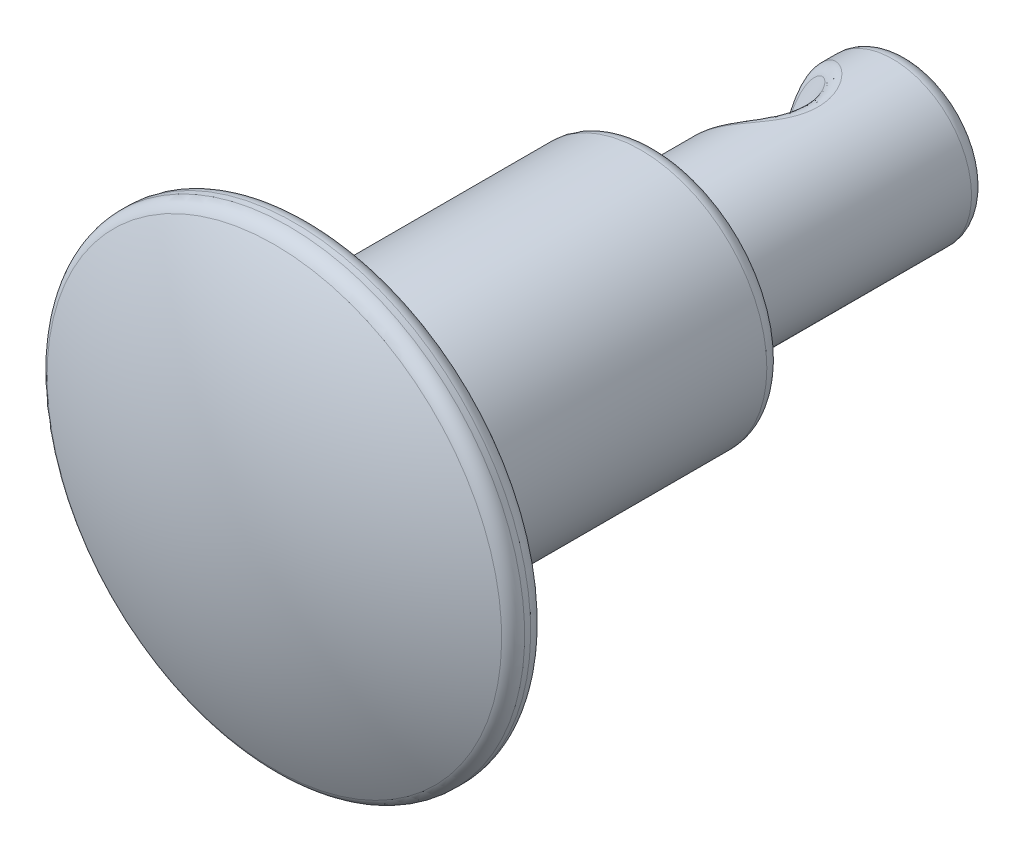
ISO-10303-21;
HEADER;
FILE_DESCRIPTION(('STEP AP214'),'2;1');
FILE_NAME('part.step','',(''),(''),'','','');
FILE_SCHEMA(('AUTOMOTIVE_DESIGN { 1 0 10303 214 1 1 1 1 }'));
ENDSEC;
DATA;
#1=APPLICATION_CONTEXT('core data for automotive mechanical design processes');
#2=APPLICATION_PROTOCOL_DEFINITION('international standard','automotive_design',2000,#1);
#3=PRODUCT_CONTEXT('',#1,'mechanical');
#4=PRODUCT('Part','Part','',(#3));
#5=PRODUCT_RELATED_PRODUCT_CATEGORY('part','',(#4));
#6=PRODUCT_DEFINITION_FORMATION('','',#4);
#7=PRODUCT_DEFINITION_CONTEXT('part definition',#1,'design');
#8=PRODUCT_DEFINITION('design','',#6,#7);
#9=PRODUCT_DEFINITION_SHAPE('','',#8);
#10=(LENGTH_UNIT() NAMED_UNIT(*) SI_UNIT(.MILLI.,.METRE.));
#11=(NAMED_UNIT(*) PLANE_ANGLE_UNIT() SI_UNIT($,.RADIAN.));
#12=(NAMED_UNIT(*) SI_UNIT($,.STERADIAN.) SOLID_ANGLE_UNIT());
#13=UNCERTAINTY_MEASURE_WITH_UNIT(LENGTH_MEASURE(1.E-05),#10,'distance_accuracy_value','');
#14=(GEOMETRIC_REPRESENTATION_CONTEXT(3) GLOBAL_UNCERTAINTY_ASSIGNED_CONTEXT((#13)) GLOBAL_UNIT_ASSIGNED_CONTEXT((#10,
#11,#12)) REPRESENTATION_CONTEXT('',''));
#15=CARTESIAN_POINT('',(0.,0.,0.));
#16=DIRECTION('',(0.,0.,1.));
#17=DIRECTION('',(1.,0.,0.));
#18=AXIS2_PLACEMENT_3D('',#15,#16,#17);
#19=CARTESIAN_POINT('',(0.,0.,10.9015307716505));
#20=DIRECTION('',(0.,0.,1.));
#21=DIRECTION('',(0.,-1.,0.));
#22=AXIS2_PLACEMENT_3D('',#19,#20,#21);
#23=CYLINDRICAL_SURFACE('',#22,2.5);
#24=CARTESIAN_POINT('',(-1.96445623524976,1.16162358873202,-9.55247852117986));
#25=CARTESIAN_POINT('',(-2.15119257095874,1.27372470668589,-9.7013854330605));
#26=CARTESIAN_POINT('',(-2.15015879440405,1.27546742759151,-9.96521545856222));
#27=CARTESIAN_POINT('',(-1.91755010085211,1.24110235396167,-9.55191166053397));
#28=CARTESIAN_POINT('',(-2.09666470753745,1.36582846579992,-9.70078815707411));
#29=CARTESIAN_POINT('',(-2.09130162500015,1.37468609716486,-9.96450688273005));
#30=CARTESIAN_POINT('',(-1.86625049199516,1.3179258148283,-9.54786829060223));
#31=CARTESIAN_POINT('',(-2.03628032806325,1.45435099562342,-9.69653723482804));
#32=CARTESIAN_POINT('',(-2.02556402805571,1.46978287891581,-9.95945267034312));
#33=CARTESIAN_POINT('',(-1.75645262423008,1.46416372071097,-9.53256783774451));
#34=CARTESIAN_POINT('',(-1.90572042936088,1.62194473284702,-9.68034796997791));
#35=CARTESIAN_POINT('',(-1.88240122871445,1.64916046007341,-9.94032710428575));
#36=CARTESIAN_POINT('',(-1.69795431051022,1.53357810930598,-9.52131069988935));
#37=CARTESIAN_POINT('',(-1.83560277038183,1.70096237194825,-9.66842288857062));
#38=CARTESIAN_POINT('',(-1.8049759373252,1.73344117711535,-9.92625568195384));
#39=CARTESIAN_POINT('',(-1.57592121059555,1.66317417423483,-9.49096261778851));
#40=CARTESIAN_POINT('',(-1.68849125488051,1.84759166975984,-9.63601489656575));
#41=CARTESIAN_POINT('',(-1.64139995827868,1.88905702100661,-9.8883205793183));
#42=CARTESIAN_POINT('',(-1.51238869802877,1.72335998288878,-9.47187519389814));
#43=CARTESIAN_POINT('',(-1.61151912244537,1.91521503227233,-9.6155496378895));
#44=CARTESIAN_POINT('',(-1.55525320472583,1.96039794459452,-9.8644612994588));
#45=CARTESIAN_POINT('',(-1.38302595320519,1.8331534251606,-9.42512636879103));
#46=CARTESIAN_POINT('',(-1.45440650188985,2.03786662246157,-9.56504849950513));
#47=CARTESIAN_POINT('',(-1.37811703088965,2.08871789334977,-9.80602526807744));
#48=CARTESIAN_POINT('',(-1.3171967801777,1.88276586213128,-9.39746887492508));
#49=CARTESIAN_POINT('',(-1.37421630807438,2.09295691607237,-9.53500984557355));
#50=CARTESIAN_POINT('',(-1.28712983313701,2.14570344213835,-9.77145340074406));
#51=CARTESIAN_POINT('',(-1.18834436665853,1.96952886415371,-9.3340286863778));
#52=CARTESIAN_POINT('',(-1.21723474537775,2.18893400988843,-9.46574586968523));
#53=CARTESIAN_POINT('',(-1.10763265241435,2.24350162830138,-9.69215316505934));
#54=CARTESIAN_POINT('',(-1.12529533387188,2.00700112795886,-9.29850694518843));
#55=CARTESIAN_POINT('',(-1.14030571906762,2.23025434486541,-9.4267677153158));
#56=CARTESIAN_POINT('',(-1.01912794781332,2.28473807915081,-9.64775098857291));
#57=CARTESIAN_POINT('',(-1.00302501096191,2.07175870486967,-9.21900999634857));
#58=CARTESIAN_POINT('',(-0.991302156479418,2.30169480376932,-9.33933647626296));
#59=CARTESIAN_POINT('',(-0.846420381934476,2.35419815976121,-9.54837980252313));
#60=CARTESIAN_POINT('',(-0.943803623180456,2.09904427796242,-9.17503500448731));
#61=CARTESIAN_POINT('',(-0.919106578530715,2.33185966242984,-9.2907938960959));
#62=CARTESIAN_POINT('',(-0.762217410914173,2.38242212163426,-9.49341106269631));
#63=CARTESIAN_POINT('',(-0.831539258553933,2.1447509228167,-9.07920582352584));
#64=CARTESIAN_POINT('',(-0.782502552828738,2.38278302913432,-9.18504619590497));
#65=CARTESIAN_POINT('',(-0.601781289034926,2.42793210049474,-9.37362458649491));
#66=CARTESIAN_POINT('',(-0.778516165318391,2.16314402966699,-9.02732744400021));
#67=CARTESIAN_POINT('',(-0.718034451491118,2.40352239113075,-9.12770141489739));
#68=CARTESIAN_POINT('',(-0.525573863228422,2.44518366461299,-9.30877661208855));
#69=CARTESIAN_POINT('',(-0.680568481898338,2.19282654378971,-8.91697459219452));
#70=CARTESIAN_POINT('',(-0.599170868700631,2.43764581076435,-9.00599067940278));
#71=CARTESIAN_POINT('',(-0.384217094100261,2.47134767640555,-9.17083554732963));
#72=CARTESIAN_POINT('',(-0.635647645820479,2.20411266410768,-8.85849708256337));
#73=CARTESIAN_POINT('',(-0.544761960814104,2.45101107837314,-8.94152303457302));
#74=CARTESIAN_POINT('',(-0.319072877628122,2.48025626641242,-9.0977386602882));
#75=CARTESIAN_POINT('',(-0.550778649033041,2.22250025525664,-8.7302108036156));
#76=CARTESIAN_POINT('',(-0.442095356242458,2.47360221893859,-8.80051585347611));
#77=CARTESIAN_POINT('',(-0.195598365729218,2.49318838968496,-8.93738081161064));
#78=CARTESIAN_POINT('',(-0.511778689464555,2.22906960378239,-8.65985372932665));
#79=CARTESIAN_POINT('',(-0.395086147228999,2.48224153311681,-8.72339410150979));
#80=CARTESIAN_POINT('',(-0.138603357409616,2.49663350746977,-8.84943446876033));
#81=CARTESIAN_POINT('',(-0.44508637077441,2.23851074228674,-8.51462677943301));
#82=CARTESIAN_POINT('',(-0.31475330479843,2.49551355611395,-8.56477600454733));
#83=CARTESIAN_POINT('',(-0.04089564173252,2.500143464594,-8.66790078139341));
#84=CARTESIAN_POINT('',(-0.41740048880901,2.24138041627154,-8.43975434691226));
#85=CARTESIAN_POINT('',(-0.281547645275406,2.50011578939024,-8.48331502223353));
#86=CARTESIAN_POINT('',(-0.000192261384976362,2.50020637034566,-8.5743102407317));
#87=CARTESIAN_POINT('',(-0.370037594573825,2.24553802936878,-8.2757640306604));
#88=CARTESIAN_POINT('',(-0.224687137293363,2.50740856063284,-8.30529395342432));
#89=CARTESIAN_POINT('',(0.0695417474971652,2.49931564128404,-8.36932234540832));
#90=CARTESIAN_POINT('',(-0.35216631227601,2.24652691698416,-8.18618470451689));
#91=CARTESIAN_POINT('',(-0.20336218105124,2.50968613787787,-8.20854919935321));
#92=CARTESIAN_POINT('',(0.0959327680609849,2.49820928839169,-8.2573481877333));
#93=CARTESIAN_POINT('',(-0.331148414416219,2.24762299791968,-8.00547495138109));
#94=CARTESIAN_POINT('',(-0.178209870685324,2.51232307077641,-8.01345270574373));
#95=CARTESIAN_POINT('',(0.126979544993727,2.49681924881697,-8.03146099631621));
#96=CARTESIAN_POINT('',(-0.32801033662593,2.24772968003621,-7.91434365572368));
#97=CARTESIAN_POINT('',(-0.174475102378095,2.51267247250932,-7.91541375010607));
#98=CARTESIAN_POINT('',(0.131622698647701,2.49653603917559,-7.91754687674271));
#99=CARTESIAN_POINT('',(-0.336805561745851,2.24733159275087,-7.7245634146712));
#100=CARTESIAN_POINT('',(-0.184991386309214,2.5116162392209,-7.71074066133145));
#101=CARTESIAN_POINT('',(0.11862254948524,2.49719819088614,-7.6803215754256));
#102=CARTESIAN_POINT('',(-0.35010636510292,2.24677150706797,-7.62596796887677));
#103=CARTESIAN_POINT('',(-0.200830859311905,2.5100557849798,-7.60452375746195));
#104=CARTESIAN_POINT('',(0.0989570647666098,2.4982552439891,-7.55707726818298));
#105=CARTESIAN_POINT('',(-0.394362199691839,2.24356190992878,-7.4322860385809));
#106=CARTESIAN_POINT('',(-0.253885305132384,2.50379216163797,-7.39477416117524));
#107=CARTESIAN_POINT('',(0.0337062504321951,2.49998449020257,-7.31497485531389));
#108=CARTESIAN_POINT('',(-0.425322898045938,2.24091172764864,-7.33720069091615));
#109=CARTESIAN_POINT('',(-0.290922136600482,2.49911271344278,-7.29156697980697));
#110=CARTESIAN_POINT('',(-0.0118873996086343,2.50065655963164,-7.19611817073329));
#111=CARTESIAN_POINT('',(-0.504551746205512,2.23037192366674,-7.15488598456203));
#112=CARTESIAN_POINT('',(-0.386314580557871,2.4839281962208,-7.09261141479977));
#113=CARTESIAN_POINT('',(-0.128053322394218,2.49738478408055,-6.96822478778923));
#114=CARTESIAN_POINT('',(-0.552591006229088,2.22255046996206,-7.06757096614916));
#115=CARTESIAN_POINT('',(-0.444169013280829,2.47355045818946,-6.99689311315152));
#116=CARTESIAN_POINT('',(-0.198295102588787,2.49350049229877,-6.85908101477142));
#117=CARTESIAN_POINT('',(-0.665304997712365,2.1971253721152,-6.9029783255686));
#118=CARTESIAN_POINT('',(-0.580551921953,2.44262630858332,-6.81593248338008));
#119=CARTESIAN_POINT('',(-0.362144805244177,2.47499096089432,-6.65334021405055));
#120=CARTESIAN_POINT('',(-0.729951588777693,2.17953821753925,-6.82568405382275));
#121=CARTESIAN_POINT('',(-0.658946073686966,2.42215843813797,-6.73053582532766));
#122=CARTESIAN_POINT('',(-0.45571319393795,2.46038381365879,-6.55672237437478));
#123=CARTESIAN_POINT('',(-0.863886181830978,2.13266703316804,-6.69344666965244));
#124=CARTESIAN_POINT('',(-0.821752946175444,2.36922422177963,-6.58454729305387));
#125=CARTESIAN_POINT('',(-0.648155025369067,2.41626127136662,-6.39142564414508));
#126=CARTESIAN_POINT('',(-0.931535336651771,2.10515731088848,-6.63691078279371));
#127=CARTESIAN_POINT('',(-0.904172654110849,2.33864231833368,-6.52202376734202));
#128=CARTESIAN_POINT('',(-0.744836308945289,2.38888074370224,-6.32075578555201));
#129=CARTESIAN_POINT('',(-1.07356312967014,2.03614494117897,-6.53562220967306));
#130=CARTESIAN_POINT('',(-1.07718949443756,2.26238824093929,-6.41045162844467));
#131=CARTESIAN_POINT('',(-0.9462921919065,2.31644438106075,-6.1941450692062));
#132=CARTESIAN_POINT('',(-1.14793504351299,1.99465616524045,-6.49085792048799));
#133=CARTESIAN_POINT('',(-1.16797174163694,2.2166743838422,-6.3612185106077));
#134=CARTESIAN_POINT('',(-1.05105868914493,2.27140606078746,-6.13818970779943));
#135=CARTESIAN_POINT('',(-1.28784728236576,1.90369787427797,-6.41895129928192));
#136=CARTESIAN_POINT('',(-1.33846115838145,2.11615133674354,-6.28260085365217));
#137=CARTESIAN_POINT('',(-1.24640302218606,2.16953292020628,-6.04830643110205));
#138=CARTESIAN_POINT('',(-1.35315523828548,1.85617691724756,-6.39021462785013));
#139=CARTESIAN_POINT('',(-1.41805244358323,2.06346045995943,-6.2513357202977));
#140=CARTESIAN_POINT('',(-1.33689981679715,2.11525486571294,-6.01238559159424));
#141=CARTESIAN_POINT('',(-1.48200163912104,1.75059236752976,-6.34124207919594));
#142=CARTESIAN_POINT('',(-1.57465163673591,1.9457224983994,-6.19833947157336));
#143=CARTESIAN_POINT('',(-1.51383953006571,1.99245558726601,-5.95116990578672));
#144=CARTESIAN_POINT('',(-1.54553915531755,1.69252335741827,-6.32101058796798));
#145=CARTESIAN_POINT('',(-1.65171896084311,1.88060953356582,-6.17660109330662));
#146=CARTESIAN_POINT('',(-1.60028033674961,1.92392704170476,-5.9258805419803));
#147=CARTESIAN_POINT('',(-1.66659645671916,1.56858345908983,-6.28875274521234));
#148=CARTESIAN_POINT('',(-1.79788414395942,1.74068364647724,-6.14209154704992));
#149=CARTESIAN_POINT('',(-1.763173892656,1.77569204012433,-5.88555823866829));
#150=CARTESIAN_POINT('',(-1.72422224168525,1.50292684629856,-6.27654552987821));
#151=CARTESIAN_POINT('',(-1.86712082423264,1.66611595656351,-6.12913299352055));
#152=CARTESIAN_POINT('',(-1.83981298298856,1.69628455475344,-5.87029921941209));
#153=CARTESIAN_POINT('',(-1.83301757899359,1.3644029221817,-6.25899044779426));
#154=CARTESIAN_POINT('',(-1.99691400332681,1.50774639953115,-6.11053074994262));
#155=CARTESIAN_POINT('',(-1.98253232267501,1.52701755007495,-5.84835536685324));
#156=CARTESIAN_POINT('',(-1.8841980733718,1.29154821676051,-6.25363081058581));
#157=CARTESIAN_POINT('',(-2.05743707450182,1.42399877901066,-6.1048877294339));
#158=CARTESIAN_POINT('',(-2.0486305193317,1.43717625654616,-5.84165582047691));
#159=CARTESIAN_POINT('',(-1.95204316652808,1.18301723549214,-6.25061062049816));
#160=CARTESIAN_POINT('',(-2.13679118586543,1.29853157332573,-6.10170540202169));
#161=CARTESIAN_POINT('',(-2.13463188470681,1.30220337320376,-5.83788058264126));
#162=CARTESIAN_POINT('',(-1.97193322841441,1.14947181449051,-6.25031545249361));
#163=CARTESIAN_POINT('',(-2.15992416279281,1.25966618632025,-6.10139411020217));
#164=CARTESIAN_POINT('',(-2.15961088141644,1.26033890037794,-5.8375116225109));
#165=CARTESIAN_POINT('',(-2.01011290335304,1.08151301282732,-6.25097154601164));
#166=CARTESIAN_POINT('',(-2.20405750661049,1.18076303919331,-6.10208556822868));
#167=CARTESIAN_POINT('',(-2.20707592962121,1.17524035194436,-5.83833173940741));
#168=CARTESIAN_POINT('',(-2.02840242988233,1.04709958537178,-6.25192287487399));
#169=CARTESIAN_POINT('',(-2.2250540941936,1.14073199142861,-6.10308827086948));
#170=CARTESIAN_POINT('',(-2.22956184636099,1.13200620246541,-5.839520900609));
#171=CARTESIAN_POINT('',(-2.08642685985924,0.931447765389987,-6.25717630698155));
#172=CARTESIAN_POINT('',(-2.29116230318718,1.0059622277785,-6.10862801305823));
#173=CARTESIAN_POINT('',(-2.30002298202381,0.986245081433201,-5.84608769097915));
#174=CARTESIAN_POINT('',(-2.12245468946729,0.848604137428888,-6.2642483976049));
#175=CARTESIAN_POINT('',(-2.33134693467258,0.909057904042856,-6.11608423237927));
#176=CARTESIAN_POINT('',(-2.34227872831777,0.881083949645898,-5.85492780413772));
#177=CARTESIAN_POINT('',(-2.18458391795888,0.68147994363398,-6.28561170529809));
#178=CARTESIAN_POINT('',(-2.39889541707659,0.712897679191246,-6.13876846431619));
#179=CARTESIAN_POINT('',(-2.41186264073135,0.667508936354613,-5.88163193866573));
#180=CARTESIAN_POINT('',(-2.2106686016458,0.597197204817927,-6.29991498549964));
#181=CARTESIAN_POINT('',(-2.42623633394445,0.6136893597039,-6.15399457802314));
#182=CARTESIAN_POINT('',(-2.43916570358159,0.559089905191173,-5.89951103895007));
#183=CARTESIAN_POINT('',(-2.25265919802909,0.4299777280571,-6.33644960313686));
#184=CARTESIAN_POINT('',(-2.46823721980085,0.416417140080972,-6.19319498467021));
#185=CARTESIAN_POINT('',(-2.47884654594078,0.342661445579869,-5.94517931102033));
#186=CARTESIAN_POINT('',(-2.26855818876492,0.347041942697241,-6.35868631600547));
#187=CARTESIAN_POINT('',(-2.4829098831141,0.318332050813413,-6.21716758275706));
#188=CARTESIAN_POINT('',(-2.4912141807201,0.234652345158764,-5.9729752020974));
#189=CARTESIAN_POINT('',(-2.29063747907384,0.185638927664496,-6.41173048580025));
#190=CARTESIAN_POINT('',(-2.50074177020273,0.127172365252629,-6.27473279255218));
#191=CARTESIAN_POINT('',(-2.50212983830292,0.0232536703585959,-6.03928041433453));
#192=CARTESIAN_POINT('',(-2.2968253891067,0.107168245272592,-6.4425312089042));
#193=CARTESIAN_POINT('',(-2.50392730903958,0.0339950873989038,-6.30833946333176));
#194=CARTESIAN_POINT('',(-2.50068868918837,-0.080139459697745,-6.07778131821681));
#195=CARTESIAN_POINT('',(-2.30083922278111,-0.0410052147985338,-6.5122701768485));
#196=CARTESIAN_POINT('',(-2.50110500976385,-0.142150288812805,-6.38473860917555));
#197=CARTESIAN_POINT('',(-2.48658258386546,-0.276411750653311,-6.16495502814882));
#198=CARTESIAN_POINT('',(-2.29883139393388,-0.110852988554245,-6.55103163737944));
#199=CARTESIAN_POINT('',(-2.49527431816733,-0.225418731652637,-6.42739661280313));
#200=CARTESIAN_POINT('',(-2.47414474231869,-0.369460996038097,-6.21340685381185));
#201=CARTESIAN_POINT('',(-2.28885008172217,-0.241512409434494,-6.63671262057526));
#202=CARTESIAN_POINT('',(-2.47759300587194,-0.381397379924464,-6.5218015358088));
#203=CARTESIAN_POINT('',(-2.44163825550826,-0.544364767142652,-6.3205080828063));
#204=CARTESIAN_POINT('',(-2.28087537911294,-0.302322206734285,-6.6836338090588));
#205=CARTESIAN_POINT('',(-2.46571273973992,-0.454216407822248,-6.57365144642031));
#206=CARTESIAN_POINT('',(-2.42156805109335,-0.626217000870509,-6.37915956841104));
#207=CARTESIAN_POINT('',(-2.26117758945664,-0.414857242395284,-6.78571355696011));
#208=CARTESIAN_POINT('',(-2.43867358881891,-0.589244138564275,-6.6863256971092));
#209=CARTESIAN_POINT('',(-2.37709431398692,-0.778362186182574,-6.50675925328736));
#210=CARTESIAN_POINT('',(-2.24938308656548,-0.46637768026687,-6.84101742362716));
#211=CARTESIAN_POINT('',(-2.42342297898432,-0.6512610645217,-6.74741936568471));
#212=CARTESIAN_POINT('',(-2.35261251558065,-0.848392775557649,-6.57588908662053));
#213=CARTESIAN_POINT('',(-2.22459886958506,-0.558626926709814,-6.95781191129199));
#214=CARTESIAN_POINT('',(-2.39259431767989,-0.762606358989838,-6.87608507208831));
#215=CARTESIAN_POINT('',(-2.30333620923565,-0.974281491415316,-6.72188219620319));
#216=CARTESIAN_POINT('',(-2.21160857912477,-0.599350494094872,-7.0193055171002));
#217=CARTESIAN_POINT('',(-2.37700211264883,-0.811908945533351,-6.94374452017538));
#218=CARTESIAN_POINT('',(-2.27854155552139,-1.03013273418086,-6.79874920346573));
#219=CARTESIAN_POINT('',(-2.18508074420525,-0.67465039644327,-7.15456588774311));
#220=CARTESIAN_POINT('',(-2.34588656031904,-0.903400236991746,-7.09210521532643));
#221=CARTESIAN_POINT('',(-2.22897237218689,-1.13374407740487,-6.96782466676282));
#222=CARTESIAN_POINT('',(-2.17165892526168,-0.707937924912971,-7.22892515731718));
#223=CARTESIAN_POINT('',(-2.33061317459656,-0.943942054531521,-7.17337871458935));
#224=CARTESIAN_POINT('',(-2.20454411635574,-1.17977661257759,-7.06077375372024));
#225=CARTESIAN_POINT('',(-2.14815622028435,-0.762625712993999,-7.38168611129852));
#226=CARTESIAN_POINT('',(-2.30426076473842,-1.01081242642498,-7.33977974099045));
#227=CARTESIAN_POINT('',(-2.16225588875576,-1.25559968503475,-7.25172494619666));
#228=CARTESIAN_POINT('',(-2.13807726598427,-0.784019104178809,-7.46009010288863));
#229=CARTESIAN_POINT('',(-2.29322415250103,-1.0370117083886,-7.42482345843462));
#230=CARTESIAN_POINT('',(-2.14439971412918,-1.28538083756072,-7.34972993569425));
#231=CARTESIAN_POINT('',(-2.12153746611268,-0.818131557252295,-7.63075195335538));
#232=CARTESIAN_POINT('',(-2.27520508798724,-1.07895340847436,-7.60964014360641));
#233=CARTESIAN_POINT('',(-2.11523198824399,-1.33293129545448,-7.56305724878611));
#234=CARTESIAN_POINT('',(-2.1158102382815,-0.829149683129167,-7.7233741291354));
#235=CARTESIAN_POINT('',(-2.26909822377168,-1.09249435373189,-7.70945242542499));
#236=CARTESIAN_POINT('',(-2.10523960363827,-1.34834194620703,-7.67883496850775));
#237=CARTESIAN_POINT('',(-2.11148694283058,-0.837524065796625,-7.90934752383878));
#238=CARTESIAN_POINT('',(-2.26446296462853,-1.10281897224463,-7.91003627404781));
#239=CARTESIAN_POINT('',(-2.09768894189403,-1.36005086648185,-7.91130171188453));
#240=CARTESIAN_POINT('',(-2.11289508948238,-0.834872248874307,-8.00269914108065));
#241=CARTESIAN_POINT('',(-2.26595553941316,-1.09955614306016,-8.01045007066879));
#242=CARTESIAN_POINT('',(-2.10013801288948,-1.35633784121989,-8.02799123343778));
#243=CARTESIAN_POINT('',(-2.12297987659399,-0.815044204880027,-8.19431183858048));
#244=CARTESIAN_POINT('',(-2.27680741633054,-1.07513145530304,-8.21730103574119));
#245=CARTESIAN_POINT('',(-2.11779088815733,-1.32863511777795,-8.26750710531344));
#246=CARTESIAN_POINT('',(-2.13215778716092,-0.796865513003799,-8.29245987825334));
#247=CARTESIAN_POINT('',(-2.2866673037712,-1.05282950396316,-8.32328706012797));
#248=CARTESIAN_POINT('',(-2.13387442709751,-1.30324599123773,-8.39019215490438));
#249=CARTESIAN_POINT('',(-2.15672093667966,-0.743338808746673,-8.48397623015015));
#250=CARTESIAN_POINT('',(-2.31378945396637,-0.987197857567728,-8.53126804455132));
#251=CARTESIAN_POINT('',(-2.17757937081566,-1.22882157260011,-8.62958759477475));
#252=CARTESIAN_POINT('',(-2.17210641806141,-0.707990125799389,-8.57734435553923));
#253=CARTESIAN_POINT('',(-2.33097318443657,-0.944076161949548,-8.63301113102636));
#254=CARTESIAN_POINT('',(-2.20520122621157,-1.17978535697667,-8.7462977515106));
#255=CARTESIAN_POINT('',(-2.20501668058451,-0.619787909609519,-8.75276188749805));
#256=CARTESIAN_POINT('',(-2.36908744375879,-0.836738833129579,-8.8250831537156));
#257=CARTESIAN_POINT('',(-2.26599038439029,-1.0581719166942,-8.96556966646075));
#258=CARTESIAN_POINT('',(-2.22244645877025,-0.567598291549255,-8.8350949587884));
#259=CARTESIAN_POINT('',(-2.38981869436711,-0.773521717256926,-8.91566457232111));
#260=CARTESIAN_POINT('',(-2.29892678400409,-0.98648942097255,-9.06848600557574));
#261=CARTESIAN_POINT('',(-2.25503953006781,-0.444262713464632,-8.98870914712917));
#262=CARTESIAN_POINT('',(-2.43050791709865,-0.624694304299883,-9.08491013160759));
#263=CARTESIAN_POINT('',(-2.36400241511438,-0.818252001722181,-9.26050374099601));
#264=CARTESIAN_POINT('',(-2.27020709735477,-0.373153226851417,-9.06001111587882));
#265=CARTESIAN_POINT('',(-2.45050189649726,-0.539165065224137,-9.16379744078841));
#266=CARTESIAN_POINT('',(-2.39614305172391,-0.721744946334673,-9.34963120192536));
#267=CARTESIAN_POINT('',(-2.29080957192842,-0.224509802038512,-9.17941187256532));
#268=CARTESIAN_POINT('',(-2.48055929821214,-0.361128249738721,-9.29559403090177));
#269=CARTESIAN_POINT('',(-2.44684881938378,-0.521515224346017,-9.49888214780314));
#270=CARTESIAN_POINT('',(-2.29733123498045,-0.149374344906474,-9.22937328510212));
#271=CARTESIAN_POINT('',(-2.49168488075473,-0.271317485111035,-9.35076120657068));
#272=CARTESIAN_POINT('',(-2.46670216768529,-0.420831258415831,-9.56133391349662));
#273=CARTESIAN_POINT('',(-2.3008919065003,0.0116110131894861,-9.31808211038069));
#274=CARTESIAN_POINT('',(-2.50377348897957,-0.0795834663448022,-9.44825196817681));
#275=CARTESIAN_POINT('',(-2.49378531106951,-0.206515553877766,-9.67221994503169));
#276=CARTESIAN_POINT('',(-2.29793568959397,0.0974554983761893,-9.356835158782));
#277=CARTESIAN_POINT('',(-2.5047704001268,0.0225304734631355,-9.49071053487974));
#278=CARTESIAN_POINT('',(-2.50102145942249,-0.0928903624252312,-9.72066125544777));
#279=CARTESIAN_POINT('',(-2.28120230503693,0.26505090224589,-9.41912368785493));
#280=CARTESIAN_POINT('',(-2.49367768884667,0.221261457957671,-9.55854334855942));
#281=CARTESIAN_POINT('',(-2.49887878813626,0.127457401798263,-9.79852191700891));
#282=CARTESIAN_POINT('',(-2.26879110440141,0.346020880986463,-9.44393981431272));
#283=CARTESIAN_POINT('',(-2.48316115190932,0.317153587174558,-9.58541044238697));
#284=CARTESIAN_POINT('',(-2.49142162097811,0.233327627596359,-9.82954207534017));
#285=CARTESIAN_POINT('',(-2.23403740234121,0.51035376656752,-9.4855686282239));
#286=CARTESIAN_POINT('',(-2.44999356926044,0.511296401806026,-9.63025237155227));
#287=CARTESIAN_POINT('',(-2.462091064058,0.44690180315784,-9.88157809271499));
#288=CARTESIAN_POINT('',(-2.21169422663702,0.593716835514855,-9.50238077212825));
#289=CARTESIAN_POINT('',(-2.42731926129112,0.609595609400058,-9.64822637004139));
#290=CARTESIAN_POINT('',(-2.44021669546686,0.554605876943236,-9.9025932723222));
#291=CARTESIAN_POINT('',(-2.15717807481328,0.759676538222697,-9.5286285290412));
#292=CARTESIAN_POINT('',(-2.36941417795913,0.804773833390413,-9.67619044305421));
#293=CARTESIAN_POINT('',(-2.38177458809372,0.767664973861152,-9.93540296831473));
#294=CARTESIAN_POINT('',(-2.12504789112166,0.842274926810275,-9.53809563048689));
#295=CARTESIAN_POINT('',(-2.33422908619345,0.90163031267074,-9.68620066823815));
#296=CARTESIAN_POINT('',(-2.34527060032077,0.873028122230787,-9.9472368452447));
#297=CARTESIAN_POINT('',(-2.05148141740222,1.00462638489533,-9.55029657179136));
#298=CARTESIAN_POINT('',(-2.25160744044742,1.09138374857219,-9.69909424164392));
#299=CARTESIAN_POINT('',(-2.25806504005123,1.0787149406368,-9.96248802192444));
#300=CARTESIAN_POINT('',(-2.01004379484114,1.08437904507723,-9.55302944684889));
#301=CARTESIAN_POINT('',(-2.204191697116,1.18420315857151,-9.70196596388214));
#302=CARTESIAN_POINT('',(-2.20736143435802,1.17903788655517,-9.96590411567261));
#303=CARTESIAN_POINT('',(-1.96445623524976,1.16162358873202,-9.55247852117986));
#304=CARTESIAN_POINT('',(-2.15119257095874,1.27372470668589,-9.7013854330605));
#305=CARTESIAN_POINT('',(-2.15015879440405,1.27546742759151,-9.96521545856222));
#306=(BOUNDED_SURFACE() B_SPLINE_SURFACE(3,2,((#24,#25,#26),(#27,#28,#29),(#30,#31,#32),(#33,
#34,#35),(#36,#37,#38),(#39,#40,#41),(#42,#43,#44),(#45,#46,#47),(#48,#49,#50),(#51,#52,#53),
(#54,#55,#56),(#57,#58,#59),(#60,#61,#62),(#63,#64,#65),(#66,#67,#68),(#69,#70,#71),(#72,#73,
#74),(#75,#76,#77),(#78,#79,#80),(#81,#82,#83),(#84,#85,#86),(#87,#88,#89),(#90,#91,#92),(#93,
#94,#95),(#96,#97,#98),(#99,#100,#101),(#102,#103,#104),(#105,#106,#107),(#108,#109,#110),(#111,
#112,#113),(#114,#115,#116),(#117,#118,#119),(#120,#121,#122),(#123,#124,#125),(#126,#127,#128),
(#129,#130,#131),(#132,#133,#134),(#135,#136,#137),(#138,#139,#140),(#141,#142,#143),(#144,#145,
#146),(#147,#148,#149),(#150,#151,#152),(#153,#154,#155),(#156,#157,#158),(#159,#160,#161),
(#162,#163,#164),(#165,#166,#167),(#168,#169,#170),(#171,#172,#173),(#174,#175,#176),(#177,#178,
#179),(#180,#181,#182),(#183,#184,#185),(#186,#187,#188),(#189,#190,#191),(#192,#193,#194),
(#195,#196,#197),(#198,#199,#200),(#201,#202,#203),(#204,#205,#206),(#207,#208,#209),(#210,#211,
#212),(#213,#214,#215),(#216,#217,#218),(#219,#220,#221),(#222,#223,#224),(#225,#226,#227),
(#228,#229,#230),(#231,#232,#233),(#234,#235,#236),(#237,#238,#239),(#240,#241,#242),(#243,#244,
#245),(#246,#247,#248),(#249,#250,#251),(#252,#253,#254),(#255,#256,#257),(#258,#259,#260),
(#261,#262,#263),(#264,#265,#266),(#267,#268,#269),(#270,#271,#272),(#273,#274,#275),(#276,#277,
#278),(#279,#280,#281),(#282,#283,#284),(#285,#286,#287),(#288,#289,#290),(#291,#292,#293),
(#294,#295,#296),(#297,#298,#299),(#300,#301,#302),(#303,#304,#305)),.UNSPECIFIED.,.T.,.F.,
.F.) B_SPLINE_SURFACE_WITH_KNOTS((4,2,2,2,2,2,2,2,2,2,2,2,2,2,2,2,2,2,2,2,2,2,2,2,2,2,2,2,2,2,2,
2,2,2,2,2,2,2,2,2,2,2,2,2,2,2,4),(3,3),(0.,0.276561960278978,0.553126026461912,
0.829565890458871,1.10587990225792,1.37412226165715,1.6423577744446,1.91143143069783,
2.1806294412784,2.47678051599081,2.77310089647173,3.11353207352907,3.45416050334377,
3.82513299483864,4.19622459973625,4.56251946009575,4.92819769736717,5.247318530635,
5.56612362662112,5.84000255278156,6.11402254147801,6.38163267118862,6.64878217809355,
6.76570760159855,6.88263934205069,7.15456035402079,7.42693649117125,7.69949753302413,
7.97184486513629,8.23869547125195,8.50560061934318,8.77781570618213,9.05016269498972,
9.35458433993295,9.65918159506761,10.0078094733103,10.356643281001,10.7298646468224,
11.1031005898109,11.4631249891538,11.8224603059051,12.1300669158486,12.4375185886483,
12.7074129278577,12.977325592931,13.2460746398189,13.5148621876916),(0.,1.),
.UNSPECIFIED.) GEOMETRIC_REPRESENTATION_ITEM() RATIONAL_B_SPLINE_SURFACE(((1.,0.884422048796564,
1.),(1.,0.88445667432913,1.),(1.,0.884711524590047,1.),(1.,0.885551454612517,1.),(1.,
0.886136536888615,1.),(1.,0.887361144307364,1.),(1.,0.888000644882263,1.),(1.,0.888969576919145,
1.),(1.,0.889299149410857,1.),(1.,0.889316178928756,1.),(1.,0.889022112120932,1.),(1.,
0.887670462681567,1.),(1.,0.886612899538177,1.),(1.,0.883779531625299,1.),(1.,0.882001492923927,
1.),(1.,0.877967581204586,1.),(1.,0.875711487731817,1.),(1.,0.870840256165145,1.),(1.,
0.868211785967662,1.),(1.,0.863291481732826,1.),(1.,0.860999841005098,1.),(1.,0.856884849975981,
1.),(1.,0.855181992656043,1.),(1.,0.853160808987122,1.),(1.,0.852843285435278,1.),(1.,
0.853705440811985,1.),(1.,0.855021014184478,1.),(1.,0.859038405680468,1.),(1.,0.861740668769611,
1.),(1.,0.867743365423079,1.),(1.,0.871035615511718,1.),(1.,0.877298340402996,1.),(1.,
0.880269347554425,1.),(1.,0.884762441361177,1.),(1.,0.886420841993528,1.),(1.,0.888634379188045,
1.),(1.,0.889190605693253,1.),(1.,0.889377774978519,1.),(1.,0.889128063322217,1.),(1.,
0.888269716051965,1.),(1.,0.887660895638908,1.),(1.,0.886455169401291,1.),(1.,0.885858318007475,
1.),(1.,0.884934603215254,1.),(1.,0.884607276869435,1.),(1.,0.884423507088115,1.),(1.,
0.884405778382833,1.),(1.,0.884445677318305,1.),(1.,0.88450330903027,1.),(1.,0.884816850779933,
1.),(1.,0.885234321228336,1.),(1.,0.886290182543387,1.),(1.,0.886928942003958,1.),(1.,
0.888115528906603,1.),(1.,0.888663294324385,1.),(1.,0.88931466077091,1.),(1.,0.88941860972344,
1.),(1.,0.888918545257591,1.),(1.,0.888328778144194,1.),(1.,0.886387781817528,1.),(1.,
0.885036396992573,1.),(1.,0.881668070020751,1.),(1.,0.879638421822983,1.),(1.,0.875226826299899,
1.),(1.,0.872844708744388,1.),(1.,0.867832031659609,1.),(1.,0.865205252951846,1.),(1.,
0.860499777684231,1.),(1.,0.858421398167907,1.),(1.,0.854973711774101,1.),(1.,0.85375033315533,
1.),(1.,0.852829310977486,1.),(1.,0.853132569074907,1.),(1.,0.855269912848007,1.),(1.,
0.857209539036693,1.),(1.,0.862232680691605,1.),(1.,0.865316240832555,1.),(1.,0.87163074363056,
1.),(1.,0.874852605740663,1.),(1.,0.880635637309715,1.),(1.,0.883198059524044,1.),(1.,
0.886753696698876,1.),(1.,0.887919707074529,1.),(1.,0.889252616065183,1.),(1.,0.889420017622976,
1.),(1.,0.889075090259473,1.),(1.,0.888643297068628,1.),(1.,0.887571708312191,1.),(1.,
0.886931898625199,1.),(1.,0.885774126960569,1.),(1.,0.885255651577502,1.),(1.,0.88456276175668,
1.),(1.,0.884388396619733,1.),(1.,0.884422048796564,1.))) REPRESENTATION_ITEM('') SURFACE());
#307=CARTESIAN_POINT('',(-2.15015879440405,1.27546742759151,-9.96521545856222));
#308=CARTESIAN_POINT('',(-2.09130162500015,1.37468609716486,-9.96450688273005));
#309=CARTESIAN_POINT('',(-2.02556402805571,1.46978287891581,-9.95945267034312));
#310=CARTESIAN_POINT('',(-1.88240122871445,1.64916046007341,-9.94032710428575));
#311=CARTESIAN_POINT('',(-1.8049759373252,1.73344117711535,-9.92625568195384));
#312=CARTESIAN_POINT('',(-1.64139995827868,1.88905702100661,-9.8883205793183));
#313=CARTESIAN_POINT('',(-1.55525320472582,1.96039794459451,-9.8644612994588));
#314=CARTESIAN_POINT('',(-1.37811703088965,2.08871789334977,-9.80602526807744));
#315=CARTESIAN_POINT('',(-1.28712983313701,2.14570344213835,-9.77145340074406));
#316=CARTESIAN_POINT('',(-1.10763265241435,2.24350162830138,-9.69215316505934));
#317=CARTESIAN_POINT('',(-1.01912794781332,2.28473807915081,-9.6477509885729));
#318=CARTESIAN_POINT('',(-0.846420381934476,2.35419815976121,-9.54837980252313));
#319=CARTESIAN_POINT('',(-0.762217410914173,2.38242212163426,-9.49341106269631));
#320=CARTESIAN_POINT('',(-0.601781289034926,2.42793210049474,-9.37362458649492));
#321=CARTESIAN_POINT('',(-0.525573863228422,2.44518366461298,-9.30877661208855));
#322=CARTESIAN_POINT('',(-0.384217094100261,2.47134767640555,-9.17083554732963));
#323=CARTESIAN_POINT('',(-0.319072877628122,2.48025626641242,-9.0977386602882));
#324=CARTESIAN_POINT('',(-0.195598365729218,2.49318838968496,-8.93738081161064));
#325=CARTESIAN_POINT('',(-0.138603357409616,2.49663350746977,-8.84943446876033));
#326=CARTESIAN_POINT('',(-0.04089564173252,2.500143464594,-8.66790078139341));
#327=CARTESIAN_POINT('',(-0.000192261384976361,2.50020637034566,-8.5743102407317));
#328=CARTESIAN_POINT('',(0.0695417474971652,2.49931564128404,-8.36932234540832));
#329=CARTESIAN_POINT('',(0.0959327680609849,2.49820928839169,-8.2573481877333));
#330=CARTESIAN_POINT('',(0.126979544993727,2.49681924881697,-8.03146099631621));
#331=CARTESIAN_POINT('',(0.131622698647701,2.49653603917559,-7.91754687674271));
#332=CARTESIAN_POINT('',(0.11862254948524,2.49719819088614,-7.6803215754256));
#333=CARTESIAN_POINT('',(0.0989570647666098,2.4982552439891,-7.55707726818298));
#334=CARTESIAN_POINT('',(0.0337062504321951,2.49998449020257,-7.31497485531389));
#335=CARTESIAN_POINT('',(-0.0118873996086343,2.50065655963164,-7.19611817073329));
#336=CARTESIAN_POINT('',(-0.128053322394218,2.49738478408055,-6.96822478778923));
#337=CARTESIAN_POINT('',(-0.198295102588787,2.49350049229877,-6.85908101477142));
#338=CARTESIAN_POINT('',(-0.362144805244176,2.47499096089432,-6.65334021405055));
#339=CARTESIAN_POINT('',(-0.45571319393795,2.46038381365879,-6.55672237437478));
#340=CARTESIAN_POINT('',(-0.648155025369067,2.41626127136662,-6.39142564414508));
#341=CARTESIAN_POINT('',(-0.744836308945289,2.38888074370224,-6.32075578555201));
#342=CARTESIAN_POINT('',(-0.9462921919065,2.31644438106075,-6.1941450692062));
#343=CARTESIAN_POINT('',(-1.05105868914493,2.27140606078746,-6.13818970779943));
#344=CARTESIAN_POINT('',(-1.24640302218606,2.16953292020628,-6.04830643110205));
#345=CARTESIAN_POINT('',(-1.33689981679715,2.11525486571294,-6.01238559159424));
#346=CARTESIAN_POINT('',(-1.51383953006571,1.99245558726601,-5.95116990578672));
#347=CARTESIAN_POINT('',(-1.60028033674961,1.92392704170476,-5.9258805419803));
#348=CARTESIAN_POINT('',(-1.763173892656,1.77569204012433,-5.88555823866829));
#349=CARTESIAN_POINT('',(-1.83981298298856,1.69628455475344,-5.87029921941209));
#350=CARTESIAN_POINT('',(-1.98253232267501,1.52701755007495,-5.84835536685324));
#351=CARTESIAN_POINT('',(-2.0486305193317,1.43717625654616,-5.84165582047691));
#352=CARTESIAN_POINT('',(-2.13463188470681,1.30220337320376,-5.83788058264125));
#353=CARTESIAN_POINT('',(-2.15961088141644,1.26033890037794,-5.8375116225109));
#354=CARTESIAN_POINT('',(-2.20707592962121,1.17524035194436,-5.83833173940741));
#355=CARTESIAN_POINT('',(-2.22956184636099,1.13200620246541,-5.839520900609));
#356=CARTESIAN_POINT('',(-2.30002298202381,0.986245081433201,-5.84608769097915));
#357=CARTESIAN_POINT('',(-2.34227872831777,0.881083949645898,-5.85492780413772));
#358=CARTESIAN_POINT('',(-2.41186264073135,0.667508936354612,-5.88163193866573));
#359=CARTESIAN_POINT('',(-2.43916570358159,0.559089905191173,-5.89951103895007));
#360=CARTESIAN_POINT('',(-2.47884654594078,0.342661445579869,-5.94517931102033));
#361=CARTESIAN_POINT('',(-2.4912141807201,0.234652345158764,-5.9729752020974));
#362=CARTESIAN_POINT('',(-2.50212983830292,0.0232536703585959,-6.03928041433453));
#363=CARTESIAN_POINT('',(-2.50068868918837,-0.080139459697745,-6.07778131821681));
#364=CARTESIAN_POINT('',(-2.48658258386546,-0.276411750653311,-6.16495502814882));
#365=CARTESIAN_POINT('',(-2.47414474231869,-0.369460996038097,-6.21340685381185));
#366=CARTESIAN_POINT('',(-2.44163825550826,-0.544364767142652,-6.3205080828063));
#367=CARTESIAN_POINT('',(-2.42156805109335,-0.626217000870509,-6.37915956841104));
#368=CARTESIAN_POINT('',(-2.37709431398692,-0.778362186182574,-6.50675925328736));
#369=CARTESIAN_POINT('',(-2.35261251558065,-0.848392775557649,-6.57588908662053));
#370=CARTESIAN_POINT('',(-2.30333620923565,-0.974281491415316,-6.72188219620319));
#371=CARTESIAN_POINT('',(-2.27854155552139,-1.03013273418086,-6.79874920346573));
#372=CARTESIAN_POINT('',(-2.22897237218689,-1.13374407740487,-6.96782466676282));
#373=CARTESIAN_POINT('',(-2.20454411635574,-1.17977661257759,-7.06077375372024));
#374=CARTESIAN_POINT('',(-2.16225588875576,-1.25559968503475,-7.25172494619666));
#375=CARTESIAN_POINT('',(-2.14439971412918,-1.28538083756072,-7.34972993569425));
#376=CARTESIAN_POINT('',(-2.11523198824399,-1.33293129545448,-7.56305724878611));
#377=CARTESIAN_POINT('',(-2.10523960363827,-1.34834194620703,-7.67883496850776));
#378=CARTESIAN_POINT('',(-2.09768894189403,-1.36005086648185,-7.91130171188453));
#379=CARTESIAN_POINT('',(-2.10013801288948,-1.35633784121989,-8.02799123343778));
#380=CARTESIAN_POINT('',(-2.11779088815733,-1.32863511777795,-8.26750710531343));
#381=CARTESIAN_POINT('',(-2.13387442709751,-1.30324599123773,-8.39019215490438));
#382=CARTESIAN_POINT('',(-2.17757937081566,-1.22882157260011,-8.62958759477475));
#383=CARTESIAN_POINT('',(-2.20520122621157,-1.17978535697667,-8.7462977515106));
#384=CARTESIAN_POINT('',(-2.26599038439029,-1.0581719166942,-8.96556966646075));
#385=CARTESIAN_POINT('',(-2.29892678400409,-0.98648942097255,-9.06848600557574));
#386=CARTESIAN_POINT('',(-2.36400241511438,-0.818252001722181,-9.26050374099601));
#387=CARTESIAN_POINT('',(-2.39614305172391,-0.721744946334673,-9.34963120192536));
#388=CARTESIAN_POINT('',(-2.44684881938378,-0.521515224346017,-9.49888214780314));
#389=CARTESIAN_POINT('',(-2.46670216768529,-0.42083125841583,-9.56133391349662));
#390=CARTESIAN_POINT('',(-2.49378531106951,-0.206515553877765,-9.67221994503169));
#391=CARTESIAN_POINT('',(-2.50102145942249,-0.0928903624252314,-9.72066125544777));
#392=CARTESIAN_POINT('',(-2.49887878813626,0.127457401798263,-9.79852191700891));
#393=CARTESIAN_POINT('',(-2.49142162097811,0.233327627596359,-9.82954207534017));
#394=CARTESIAN_POINT('',(-2.462091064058,0.44690180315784,-9.88157809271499));
#395=CARTESIAN_POINT('',(-2.44021669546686,0.554605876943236,-9.9025932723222));
#396=CARTESIAN_POINT('',(-2.38177458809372,0.767664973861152,-9.93540296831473));
#397=CARTESIAN_POINT('',(-2.34527060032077,0.873028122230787,-9.9472368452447));
#398=CARTESIAN_POINT('',(-2.25806504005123,1.0787149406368,-9.96248802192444));
#399=CARTESIAN_POINT('',(-2.20736143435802,1.17903788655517,-9.96590411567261));
#400=CARTESIAN_POINT('',(-2.15015879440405,1.27546742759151,-9.96521545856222));
#401=B_SPLINE_CURVE_WITH_KNOTS('',3,(#307,#308,#309,#310,#311,#312,#313,#314,#315,#316,#317,
#318,#319,#320,#321,#322,#323,#324,#325,#326,#327,#328,#329,#330,#331,#332,#333,#334,#335,#336,
#337,#338,#339,#340,#341,#342,#343,#344,#345,#346,#347,#348,#349,#350,#351,#352,#353,#354,#355,
#356,#357,#358,#359,#360,#361,#362,#363,#364,#365,#366,#367,#368,#369,#370,#371,#372,#373,#374,
#375,#376,#377,#378,#379,#380,#381,#382,#383,#384,#385,#386,#387,#388,#389,#390,#391,#392,#393,
#394,#395,#396,#397,#398,#399,#400),.UNSPECIFIED.,.T.,.F.,(4,2,2,2,2,2,2,2,2,2,2,2,2,2,2,2,2,2,
2,2,2,2,2,2,2,2,2,2,2,2,2,2,2,2,2,2,2,2,2,2,2,2,2,2,2,2,4),(0.,0.276561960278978,
0.553126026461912,0.829565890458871,1.10587990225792,1.37412226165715,1.6423577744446,
1.91143143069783,2.1806294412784,2.47678051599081,2.77310089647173,3.11353207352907,
3.45416050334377,3.82513299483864,4.19622459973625,4.56251946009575,4.92819769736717,
5.247318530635,5.56612362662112,5.84000255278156,6.11402254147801,6.38163267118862,
6.64878217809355,6.76570760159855,6.88263934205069,7.15456035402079,7.42693649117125,
7.69949753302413,7.97184486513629,8.23869547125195,8.50560061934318,8.77781570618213,
9.05016269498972,9.35458433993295,9.65918159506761,10.0078094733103,10.356643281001,
10.7298646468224,11.1031005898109,11.4631249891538,11.8224603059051,12.1300669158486,
12.4375185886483,12.7074129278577,12.977325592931,13.2460746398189,13.5148621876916),.UNSPECIFIED.);
#402=CARTESIAN_POINT('',(-2.15015879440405,1.27546742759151,-9.96521545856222));
#403=VERTEX_POINT('',#402);
#404=EDGE_CURVE('E10',#403,#403,#401,.T.);
#405=ORIENTED_EDGE('',*,*,#404,.T.);
#406=EDGE_LOOP('',(#405));
#407=FACE_BOUND('',#406,.T.);
#408=CARTESIAN_POINT('',(0.,0.,-3.40153077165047));
#409=DIRECTION('',(0.,0.,1.));
#410=DIRECTION('',(0.,-1.,0.));
#411=AXIS2_PLACEMENT_3D('',#408,#409,#410);
#412=CIRCLE('',#411,2.5);
#413=CARTESIAN_POINT('',(0.,-2.5,-3.40153077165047));
#414=VERTEX_POINT('',#413);
#415=EDGE_CURVE('E257',#414,#414,#412,.F.);
#416=ORIENTED_EDGE('',*,*,#415,.T.);
#417=EDGE_LOOP('',(#416));
#418=FACE_BOUND('',#417,.T.);
#419=CARTESIAN_POINT('',(0.,0.,-10.4015307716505));
#420=DIRECTION('',(0.,0.,1.));
#421=DIRECTION('',(0.,-1.,0.));
#422=AXIS2_PLACEMENT_3D('',#419,#420,#421);
#423=CIRCLE('',#422,2.5);
#424=CARTESIAN_POINT('',(0.,-2.5,-10.4015307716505));
#425=VERTEX_POINT('',#424);
#426=EDGE_CURVE('E252',#425,#425,#423,.T.);
#427=ORIENTED_EDGE('',*,*,#426,.T.);
#428=EDGE_LOOP('',(#427));
#429=FACE_BOUND('',#428,.T.);
#430=ADVANCED_FACE('F29',(#407,#418,#429),#23,.T.);
#431=CARTESIAN_POINT('',(0.,0.,-5.59846922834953));
#432=DIRECTION('',(0.,0.,1.));
#433=DIRECTION('',(0.,1.,0.));
#434=AXIS2_PLACEMENT_3D('',#431,#432,#433);
#435=SPHERICAL_SURFACE('',#434,16.5);
#436=CARTESIAN_POINT('',(0.,0.,9.23863454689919));
#437=DIRECTION('',(0.,0.,-1.));
#438=DIRECTION('',(0.,1.,0.));
#439=AXIS2_PLACEMENT_3D('',#436,#437,#438);
#440=CIRCLE('',#439,7.21875);
#441=CARTESIAN_POINT('',(0.,7.21875,9.23863454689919));
#442=VERTEX_POINT('',#441);
#443=EDGE_CURVE('E116',#442,#442,#440,.F.);
#444=ORIENTED_EDGE('',*,*,#443,.T.);
#445=EDGE_LOOP('',(#444));
#446=FACE_BOUND('',#445,.T.);
#447=ADVANCED_FACE('F60',(#446),#435,.T.);
#448=CARTESIAN_POINT('',(0.,0.,-10.9015307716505));
#449=DIRECTION('',(0.,0.,1.));
#450=DIRECTION('',(0.,-1.,0.));
#451=AXIS2_PLACEMENT_3D('',#448,#449,#450);
#452=PLANE('',#451);
#453=CARTESIAN_POINT('',(0.,0.,-10.9015307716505));
#454=DIRECTION('',(0.,0.,1.));
#455=DIRECTION('',(0.,-1.,0.));
#456=AXIS2_PLACEMENT_3D('',#453,#454,#455);
#457=CIRCLE('',#456,2.);
#458=CARTESIAN_POINT('',(0.,-2.,-10.9015307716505));
#459=VERTEX_POINT('',#458);
#460=EDGE_CURVE('E250',#459,#459,#457,.F.);
#461=ORIENTED_EDGE('',*,*,#460,.T.);
#462=EDGE_LOOP('',(#461));
#463=FACE_BOUND('',#462,.T.);
#464=ADVANCED_FACE('F63',(#463),#452,.F.);
#465=CARTESIAN_POINT('',(0.,2.5,-2.90153077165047));
#466=DIRECTION('',(0.,0.,1.));
#467=DIRECTION('',(0.,-1.,0.));
#468=AXIS2_PLACEMENT_3D('',#465,#466,#467);
#469=PLANE('',#468);
#470=CARTESIAN_POINT('',(0.,0.,-2.90153077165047));
#471=DIRECTION('',(0.,0.,1.));
#472=DIRECTION('',(0.,-1.,0.));
#473=AXIS2_PLACEMENT_3D('',#470,#471,#472);
#474=CIRCLE('',#473,3.);
#475=CARTESIAN_POINT('',(0.,-3.,-2.90153077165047));
#476=VERTEX_POINT('',#475);
#477=EDGE_CURVE('E102',#476,#476,#474,.T.);
#478=ORIENTED_EDGE('',*,*,#477,.T.);
#479=EDGE_LOOP('',(#478));
#480=FACE_BOUND('',#479,.T.);
#481=CARTESIAN_POINT('',(0.,0.,-2.90153077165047));
#482=DIRECTION('',(0.,0.,1.));
#483=DIRECTION('',(0.,-1.,0.));
#484=AXIS2_PLACEMENT_3D('',#481,#482,#483);
#485=CIRCLE('',#484,3.5);
#486=CARTESIAN_POINT('',(0.,-3.5,-2.90153077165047));
#487=VERTEX_POINT('',#486);
#488=EDGE_CURVE('E107',#487,#487,#485,.F.);
#489=ORIENTED_EDGE('',*,*,#488,.T.);
#490=EDGE_LOOP('',(#489));
#491=FACE_BOUND('',#490,.T.);
#492=ADVANCED_FACE('F61',(#480,#491),#469,.F.);
#493=CARTESIAN_POINT('',(0.,0.,10.9015307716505));
#494=DIRECTION('',(0.,0.,1.));
#495=DIRECTION('',(0.,-1.,0.));
#496=AXIS2_PLACEMENT_3D('',#493,#494,#495);
#497=CYLINDRICAL_SURFACE('',#496,4.);
#498=CARTESIAN_POINT('',(0.,0.,-2.40153077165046));
#499=DIRECTION('',(0.,0.,1.));
#500=DIRECTION('',(0.,-1.,0.));
#501=AXIS2_PLACEMENT_3D('',#498,#499,#500);
#502=CIRCLE('',#501,4.);
#503=CARTESIAN_POINT('',(0.,-4.,-2.40153077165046));
#504=VERTEX_POINT('',#503);
#505=EDGE_CURVE('E97',#504,#504,#502,.T.);
#506=ORIENTED_EDGE('',*,*,#505,.T.);
#507=EDGE_LOOP('',(#506));
#508=FACE_BOUND('',#507,.T.);
#509=CARTESIAN_POINT('',(0.,0.,7.59846922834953));
#510=DIRECTION('',(0.,0.,1.));
#511=DIRECTION('',(0.,-1.,0.));
#512=AXIS2_PLACEMENT_3D('',#509,#510,#511);
#513=CIRCLE('',#512,4.);
#514=CARTESIAN_POINT('',(0.,-4.,7.59846922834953));
#515=VERTEX_POINT('',#514);
#516=EDGE_CURVE('E100',#515,#515,#513,.F.);
#517=ORIENTED_EDGE('',*,*,#516,.T.);
#518=EDGE_LOOP('',(#517));
#519=FACE_BOUND('',#518,.T.);
#520=ADVANCED_FACE('F86',(#508,#519),#497,.T.);
#521=CARTESIAN_POINT('',(0.,4.,8.09846922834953));
#522=DIRECTION('',(0.,0.,1.));
#523=DIRECTION('',(0.,-1.,0.));
#524=AXIS2_PLACEMENT_3D('',#521,#522,#523);
#525=PLANE('',#524);
#526=CARTESIAN_POINT('',(0.,0.,8.09846922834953));
#527=DIRECTION('',(0.,0.,1.));
#528=DIRECTION('',(0.,-1.,0.));
#529=AXIS2_PLACEMENT_3D('',#526,#527,#528);
#530=CIRCLE('',#529,4.5);
#531=CARTESIAN_POINT('',(0.,-4.5,8.09846922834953));
#532=VERTEX_POINT('',#531);
#533=EDGE_CURVE('E113',#532,#532,#530,.T.);
#534=ORIENTED_EDGE('',*,*,#533,.T.);
#535=EDGE_LOOP('',(#534));
#536=FACE_BOUND('',#535,.T.);
#537=CARTESIAN_POINT('',(0.,0.,8.09846922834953));
#538=DIRECTION('',(0.,0.,1.));
#539=DIRECTION('',(0.,-1.,0.));
#540=AXIS2_PLACEMENT_3D('',#537,#538,#539);
#541=CIRCLE('',#540,7.);
#542=CARTESIAN_POINT('',(0.,-7.,8.09846922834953));
#543=VERTEX_POINT('',#542);
#544=EDGE_CURVE('E104',#543,#543,#541,.F.);
#545=ORIENTED_EDGE('',*,*,#544,.T.);
#546=EDGE_LOOP('',(#545));
#547=FACE_BOUND('',#546,.T.);
#548=ADVANCED_FACE('F83',(#536,#547),#525,.F.);
#549=CARTESIAN_POINT('',(0.,0.,10.9015307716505));
#550=DIRECTION('',(0.,0.,1.));
#551=DIRECTION('',(0.,-1.,0.));
#552=AXIS2_PLACEMENT_3D('',#549,#550,#551);
#553=CYLINDRICAL_SURFACE('',#552,7.5);
#554=CARTESIAN_POINT('',(0.,0.,8.78902534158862));
#555=DIRECTION('',(0.,0.,-1.));
#556=DIRECTION('',(0.,1.,0.));
#557=AXIS2_PLACEMENT_3D('',#554,#555,#556);
#558=CIRCLE('',#557,7.5);
#559=CARTESIAN_POINT('',(0.,7.5,8.78902534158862));
#560=VERTEX_POINT('',#559);
#561=EDGE_CURVE('E43',#560,#560,#558,.T.);
#562=ORIENTED_EDGE('',*,*,#561,.T.);
#563=EDGE_LOOP('',(#562));
#564=FACE_BOUND('',#563,.T.);
#565=CARTESIAN_POINT('',(0.,0.,8.59846922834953));
#566=DIRECTION('',(0.,0.,1.));
#567=DIRECTION('',(0.,-1.,0.));
#568=AXIS2_PLACEMENT_3D('',#565,#566,#567);
#569=CIRCLE('',#568,7.5);
#570=CARTESIAN_POINT('',(0.,-7.5,8.59846922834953));
#571=VERTEX_POINT('',#570);
#572=EDGE_CURVE('E119',#571,#571,#569,.T.);
#573=ORIENTED_EDGE('',*,*,#572,.T.);
#574=EDGE_LOOP('',(#573));
#575=FACE_BOUND('',#574,.T.);
#576=ADVANCED_FACE('F78',(#564,#575),#553,.T.);
#577=CARTESIAN_POINT('',(0.,0.,-10.4015307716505));
#578=DIRECTION('',(0.,0.,1.));
#579=DIRECTION('',(0.,-1.,0.));
#580=AXIS2_PLACEMENT_3D('',#577,#578,#579);
#581=TOROIDAL_SURFACE('',#580,2.,0.5);
#582=ORIENTED_EDGE('',*,*,#460,.F.);
#583=EDGE_LOOP('',(#582));
#584=FACE_BOUND('',#583,.T.);
#585=ORIENTED_EDGE('',*,*,#426,.F.);
#586=EDGE_LOOP('',(#585));
#587=FACE_BOUND('',#586,.T.);
#588=ADVANCED_FACE('F82',(#584,#587),#581,.T.);
#589=CARTESIAN_POINT('',(0.,0.,-3.40153077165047));
#590=DIRECTION('',(0.,0.,1.));
#591=DIRECTION('',(0.,-1.,0.));
#592=AXIS2_PLACEMENT_3D('',#589,#590,#591);
#593=TOROIDAL_SURFACE('',#592,3.,0.5);
#594=ORIENTED_EDGE('',*,*,#415,.F.);
#595=EDGE_LOOP('',(#594));
#596=FACE_BOUND('',#595,.T.);
#597=ORIENTED_EDGE('',*,*,#477,.F.);
#598=EDGE_LOOP('',(#597));
#599=FACE_BOUND('',#598,.T.);
#600=ADVANCED_FACE('F140',(#596,#599),#593,.F.);
#601=CARTESIAN_POINT('',(0.,0.,-2.40153077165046));
#602=DIRECTION('',(0.,0.,1.));
#603=DIRECTION('',(0.,-1.,0.));
#604=AXIS2_PLACEMENT_3D('',#601,#602,#603);
#605=TOROIDAL_SURFACE('',#604,3.5,0.5);
#606=ORIENTED_EDGE('',*,*,#488,.F.);
#607=EDGE_LOOP('',(#606));
#608=FACE_BOUND('',#607,.T.);
#609=ORIENTED_EDGE('',*,*,#505,.F.);
#610=EDGE_LOOP('',(#609));
#611=FACE_BOUND('',#610,.T.);
#612=ADVANCED_FACE('F144',(#608,#611),#605,.T.);
#613=CARTESIAN_POINT('',(0.,0.,7.59846922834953));
#614=DIRECTION('',(0.,0.,1.));
#615=DIRECTION('',(0.,-1.,0.));
#616=AXIS2_PLACEMENT_3D('',#613,#614,#615);
#617=TOROIDAL_SURFACE('',#616,4.5,0.5);
#618=ORIENTED_EDGE('',*,*,#516,.F.);
#619=EDGE_LOOP('',(#618));
#620=FACE_BOUND('',#619,.T.);
#621=ORIENTED_EDGE('',*,*,#533,.F.);
#622=EDGE_LOOP('',(#621));
#623=FACE_BOUND('',#622,.T.);
#624=ADVANCED_FACE('F128',(#620,#623),#617,.F.);
#625=CARTESIAN_POINT('',(0.,0.,8.78902534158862));
#626=DIRECTION('',(0.,0.,-1.));
#627=DIRECTION('',(0.,1.,0.));
#628=AXIS2_PLACEMENT_3D('',#625,#626,#627);
#629=TOROIDAL_SURFACE('',#628,7.,0.5);
#630=ORIENTED_EDGE('',*,*,#561,.F.);
#631=EDGE_LOOP('',(#630));
#632=FACE_BOUND('',#631,.T.);
#633=ORIENTED_EDGE('',*,*,#443,.F.);
#634=EDGE_LOOP('',(#633));
#635=FACE_BOUND('',#634,.T.);
#636=ADVANCED_FACE('F125',(#632,#635),#629,.T.);
#637=CARTESIAN_POINT('',(0.,0.,8.59846922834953));
#638=DIRECTION('',(0.,0.,1.));
#639=DIRECTION('',(0.,-1.,0.));
#640=AXIS2_PLACEMENT_3D('',#637,#638,#639);
#641=TOROIDAL_SURFACE('',#640,7.,0.5);
#642=ORIENTED_EDGE('',*,*,#544,.F.);
#643=EDGE_LOOP('',(#642));
#644=FACE_BOUND('',#643,.T.);
#645=ORIENTED_EDGE('',*,*,#572,.F.);
#646=EDGE_LOOP('',(#645));
#647=FACE_BOUND('',#646,.T.);
#648=ADVANCED_FACE('F76',(#644,#647),#641,.T.);
#649=CARTESIAN_POINT('',(-8.0814618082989,-7.16384994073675,-7.90153077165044));
#650=DIRECTION('',(0.50049452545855,0.86573970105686,0.));
#651=DIRECTION('',(-0.86573970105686,0.50049452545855,0.));
#652=AXIS2_PLACEMENT_3D('',#649,#650,#651);
#653=CYLINDRICAL_SURFACE('',#652,2.);
#654=CARTESIAN_POINT('',(-1.96445623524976,1.16162358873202,-9.55247852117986));
#655=CARTESIAN_POINT('',(-2.01004379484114,1.08437904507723,-9.55302944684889));
#656=CARTESIAN_POINT('',(-2.05148141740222,1.00462638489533,-9.55029657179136));
#657=CARTESIAN_POINT('',(-2.12504789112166,0.842274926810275,-9.53809563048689));
#658=CARTESIAN_POINT('',(-2.15717807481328,0.759676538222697,-9.5286285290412));
#659=CARTESIAN_POINT('',(-2.21169422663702,0.593716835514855,-9.50238077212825));
#660=CARTESIAN_POINT('',(-2.23403740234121,0.51035376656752,-9.4855686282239));
#661=CARTESIAN_POINT('',(-2.26879110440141,0.346020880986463,-9.44393981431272));
#662=CARTESIAN_POINT('',(-2.28120230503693,0.26505090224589,-9.41912368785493));
#663=CARTESIAN_POINT('',(-2.29793568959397,0.0974554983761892,-9.356835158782));
#664=CARTESIAN_POINT('',(-2.3008919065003,0.0116110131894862,-9.31808211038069));
#665=CARTESIAN_POINT('',(-2.29733123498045,-0.149374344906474,-9.22937328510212));
#666=CARTESIAN_POINT('',(-2.29080957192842,-0.224509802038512,-9.17941187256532));
#667=CARTESIAN_POINT('',(-2.27020709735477,-0.373153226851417,-9.06001111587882));
#668=CARTESIAN_POINT('',(-2.25503953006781,-0.444262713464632,-8.98870914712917));
#669=CARTESIAN_POINT('',(-2.22244645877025,-0.567598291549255,-8.8350949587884));
#670=CARTESIAN_POINT('',(-2.20501668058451,-0.619787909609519,-8.75276188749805));
#671=CARTESIAN_POINT('',(-2.17210641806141,-0.70799012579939,-8.57734435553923));
#672=CARTESIAN_POINT('',(-2.15672093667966,-0.743338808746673,-8.48397623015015));
#673=CARTESIAN_POINT('',(-2.13215778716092,-0.796865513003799,-8.29245987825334));
#674=CARTESIAN_POINT('',(-2.12297987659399,-0.815044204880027,-8.19431183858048));
#675=CARTESIAN_POINT('',(-2.11289508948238,-0.834872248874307,-8.00269914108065));
#676=CARTESIAN_POINT('',(-2.11148694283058,-0.837524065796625,-7.90934752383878));
#677=CARTESIAN_POINT('',(-2.1158102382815,-0.829149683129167,-7.7233741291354));
#678=CARTESIAN_POINT('',(-2.12153746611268,-0.818131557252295,-7.63075195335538));
#679=CARTESIAN_POINT('',(-2.13807726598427,-0.784019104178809,-7.46009010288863));
#680=CARTESIAN_POINT('',(-2.14815622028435,-0.762625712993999,-7.38168611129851));
#681=CARTESIAN_POINT('',(-2.17165892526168,-0.707937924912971,-7.22892515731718));
#682=CARTESIAN_POINT('',(-2.18508074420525,-0.67465039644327,-7.15456588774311));
#683=CARTESIAN_POINT('',(-2.21160857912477,-0.599350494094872,-7.0193055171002));
#684=CARTESIAN_POINT('',(-2.22459886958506,-0.558626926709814,-6.95781191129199));
#685=CARTESIAN_POINT('',(-2.24938308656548,-0.46637768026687,-6.84101742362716));
#686=CARTESIAN_POINT('',(-2.26117758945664,-0.414857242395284,-6.78571355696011));
#687=CARTESIAN_POINT('',(-2.28087537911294,-0.302322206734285,-6.6836338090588));
#688=CARTESIAN_POINT('',(-2.28885008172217,-0.241512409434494,-6.63671262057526));
#689=CARTESIAN_POINT('',(-2.29883139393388,-0.110852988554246,-6.55103163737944));
#690=CARTESIAN_POINT('',(-2.30083922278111,-0.0410052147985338,-6.5122701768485));
#691=CARTESIAN_POINT('',(-2.2968253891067,0.107168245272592,-6.4425312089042));
#692=CARTESIAN_POINT('',(-2.29063747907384,0.185638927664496,-6.41173048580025));
#693=CARTESIAN_POINT('',(-2.26855818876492,0.347041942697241,-6.35868631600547));
#694=CARTESIAN_POINT('',(-2.25265919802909,0.4299777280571,-6.33644960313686));
#695=CARTESIAN_POINT('',(-2.2106686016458,0.597197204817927,-6.29991498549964));
#696=CARTESIAN_POINT('',(-2.18458391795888,0.68147994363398,-6.28561170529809));
#697=CARTESIAN_POINT('',(-2.12245468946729,0.848604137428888,-6.2642483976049));
#698=CARTESIAN_POINT('',(-2.08642685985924,0.931447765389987,-6.25717630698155));
#699=CARTESIAN_POINT('',(-2.02840242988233,1.04709958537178,-6.25192287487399));
#700=CARTESIAN_POINT('',(-2.01011290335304,1.08151301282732,-6.25097154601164));
#701=CARTESIAN_POINT('',(-1.97193322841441,1.14947181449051,-6.25031545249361));
#702=CARTESIAN_POINT('',(-1.95204316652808,1.18301723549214,-6.25061062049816));
#703=CARTESIAN_POINT('',(-1.8841980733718,1.29154821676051,-6.25363081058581));
#704=CARTESIAN_POINT('',(-1.83301757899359,1.3644029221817,-6.25899044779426));
#705=CARTESIAN_POINT('',(-1.72422224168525,1.50292684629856,-6.27654552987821));
#706=CARTESIAN_POINT('',(-1.66659645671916,1.56858345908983,-6.28875274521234));
#707=CARTESIAN_POINT('',(-1.54553915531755,1.69252335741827,-6.32101058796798));
#708=CARTESIAN_POINT('',(-1.48200163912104,1.75059236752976,-6.34124207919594));
#709=CARTESIAN_POINT('',(-1.35315523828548,1.85617691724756,-6.39021462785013));
#710=CARTESIAN_POINT('',(-1.28784728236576,1.90369787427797,-6.41895129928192));
#711=CARTESIAN_POINT('',(-1.14793504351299,1.99465616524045,-6.49085792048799));
#712=CARTESIAN_POINT('',(-1.07356312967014,2.03614494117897,-6.53562220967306));
#713=CARTESIAN_POINT('',(-0.931535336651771,2.10515731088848,-6.63691078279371));
#714=CARTESIAN_POINT('',(-0.863886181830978,2.13266703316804,-6.69344666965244));
#715=CARTESIAN_POINT('',(-0.729951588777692,2.17953821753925,-6.82568405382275));
#716=CARTESIAN_POINT('',(-0.665304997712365,2.1971253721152,-6.9029783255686));
#717=CARTESIAN_POINT('',(-0.552591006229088,2.22255046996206,-7.06757096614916));
#718=CARTESIAN_POINT('',(-0.504551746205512,2.23037192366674,-7.15488598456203));
#719=CARTESIAN_POINT('',(-0.425322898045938,2.24091172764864,-7.33720069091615));
#720=CARTESIAN_POINT('',(-0.394362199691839,2.24356190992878,-7.4322860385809));
#721=CARTESIAN_POINT('',(-0.35010636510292,2.24677150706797,-7.62596796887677));
#722=CARTESIAN_POINT('',(-0.336805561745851,2.24733159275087,-7.7245634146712));
#723=CARTESIAN_POINT('',(-0.32801033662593,2.24772968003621,-7.91434365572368));
#724=CARTESIAN_POINT('',(-0.331148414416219,2.24762299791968,-8.00547495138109));
#725=CARTESIAN_POINT('',(-0.35216631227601,2.24652691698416,-8.18618470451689));
#726=CARTESIAN_POINT('',(-0.370037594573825,2.24553802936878,-8.2757640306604));
#727=CARTESIAN_POINT('',(-0.41740048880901,2.24138041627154,-8.43975434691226));
#728=CARTESIAN_POINT('',(-0.44508637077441,2.23851074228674,-8.51462677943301));
#729=CARTESIAN_POINT('',(-0.511778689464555,2.22906960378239,-8.65985372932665));
#730=CARTESIAN_POINT('',(-0.550778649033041,2.22250025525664,-8.7302108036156));
#731=CARTESIAN_POINT('',(-0.635647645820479,2.20411266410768,-8.85849708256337));
#732=CARTESIAN_POINT('',(-0.680568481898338,2.19282654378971,-8.91697459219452));
#733=CARTESIAN_POINT('',(-0.778516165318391,2.16314402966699,-9.02732744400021));
#734=CARTESIAN_POINT('',(-0.831539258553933,2.1447509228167,-9.07920582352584));
#735=CARTESIAN_POINT('',(-0.943803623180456,2.09904427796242,-9.17503500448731));
#736=CARTESIAN_POINT('',(-1.00302501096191,2.07175870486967,-9.21900999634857));
#737=CARTESIAN_POINT('',(-1.12529533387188,2.00700112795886,-9.29850694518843));
#738=CARTESIAN_POINT('',(-1.18834436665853,1.96952886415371,-9.3340286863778));
#739=CARTESIAN_POINT('',(-1.3171967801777,1.88276586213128,-9.39746887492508));
#740=CARTESIAN_POINT('',(-1.38302595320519,1.8331534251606,-9.42512636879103));
#741=CARTESIAN_POINT('',(-1.51238869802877,1.72335998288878,-9.47187519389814));
#742=CARTESIAN_POINT('',(-1.57592121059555,1.66317417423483,-9.49096261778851));
#743=CARTESIAN_POINT('',(-1.69795431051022,1.53357810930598,-9.52131069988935));
#744=CARTESIAN_POINT('',(-1.75645262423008,1.46416372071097,-9.53256783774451));
#745=CARTESIAN_POINT('',(-1.86625049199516,1.3179258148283,-9.54786829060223));
#746=CARTESIAN_POINT('',(-1.91755010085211,1.24110235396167,-9.55191166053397));
#747=CARTESIAN_POINT('',(-1.96445623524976,1.16162358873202,-9.55247852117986));
#748=B_SPLINE_CURVE_WITH_KNOTS('',3,(#654,#655,#656,#657,#658,#659,#660,#661,#662,#663,#664,
#665,#666,#667,#668,#669,#670,#671,#672,#673,#674,#675,#676,#677,#678,#679,#680,#681,#682,#683,
#684,#685,#686,#687,#688,#689,#690,#691,#692,#693,#694,#695,#696,#697,#698,#699,#700,#701,#702,
#703,#704,#705,#706,#707,#708,#709,#710,#711,#712,#713,#714,#715,#716,#717,#718,#719,#720,#721,
#722,#723,#724,#725,#726,#727,#728,#729,#730,#731,#732,#733,#734,#735,#736,#737,#738,#739,#740,
#741,#742,#743,#744,#745,#746,#747),.UNSPECIFIED.,.T.,.F.,(4,2,2,2,2,2,2,2,2,2,2,2,2,2,2,2,2,2,
2,2,2,2,2,2,2,2,2,2,2,2,2,2,2,2,2,2,2,2,2,2,2,2,2,2,2,2,4),(0.,0.268787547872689,
0.537536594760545,0.80744925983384,1.07734359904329,1.38479527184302,1.6924018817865,
2.05173719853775,2.41176159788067,2.78499754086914,3.15821890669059,3.50705271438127,
3.85568059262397,4.16027784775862,4.46469949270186,4.73704648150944,5.0092615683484,
5.27616671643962,5.54301732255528,5.81536465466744,6.08792569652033,6.36030183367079,
6.63222284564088,6.74915458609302,6.86608000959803,7.13322951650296,7.40083964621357,
7.67485963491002,7.94873856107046,8.26754365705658,8.58666449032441,8.95234272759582,
9.31863758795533,9.68972919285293,10.0607016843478,10.4013301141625,10.7417612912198,
11.0380816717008,11.3342327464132,11.6034307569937,11.872504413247,12.1407399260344,
12.4089822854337,12.6852962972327,12.9617361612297,13.2383002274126,13.5148621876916),.UNSPECIFIED.);
#749=CARTESIAN_POINT('',(-1.96445623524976,1.16162358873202,-9.55247852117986));
#750=VERTEX_POINT('',#749);
#751=EDGE_CURVE('E39',#750,#750,#748,.T.);
#752=ORIENTED_EDGE('',*,*,#751,.T.);
#753=EDGE_LOOP('',(#752));
#754=FACE_BOUND('',#753,.T.);
#755=ADVANCED_FACE('F69',(#754),#653,.F.);
#756=CARTESIAN_POINT('',(-1.72012703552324,1.02037394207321,-9.96521545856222));
#757=DIRECTION('',(0.510171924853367,0.860038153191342,0.00767998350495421));
#758=DIRECTION('',(-0.860063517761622,0.510186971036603,0.));
#759=AXIS2_PLACEMENT_3D('',#756,#757,#758);
#760=CIRCLE('',#759,0.5);
#761=EDGE_CURVE('',#403,#750,#760,.T.);
#762=ORIENTED_EDGE('',*,*,#404,.F.);
#763=ORIENTED_EDGE('',*,*,#751,.F.);
#764=ORIENTED_EDGE('',*,*,#761,.T.);
#765=ORIENTED_EDGE('',*,*,#761,.F.);
#766=EDGE_LOOP('',(#762,#764,#763,#765));
#767=FACE_BOUND('',#766,.T.);
#768=ADVANCED_FACE('F66',(#767),#306,.T.);
#769=CLOSED_SHELL('',(#430,#447,#464,#492,#520,#548,#576,#588,#600,#612,#624,#636,#648,#755,#768));
#770=MANIFOLD_SOLID_BREP('B2',#769);
#771=ADVANCED_BREP_SHAPE_REPRESENTATION('',(#18,#770),#14);
#772=SHAPE_DEFINITION_REPRESENTATION(#9,#771);
ENDSEC;
END-ISO-10303-21;
